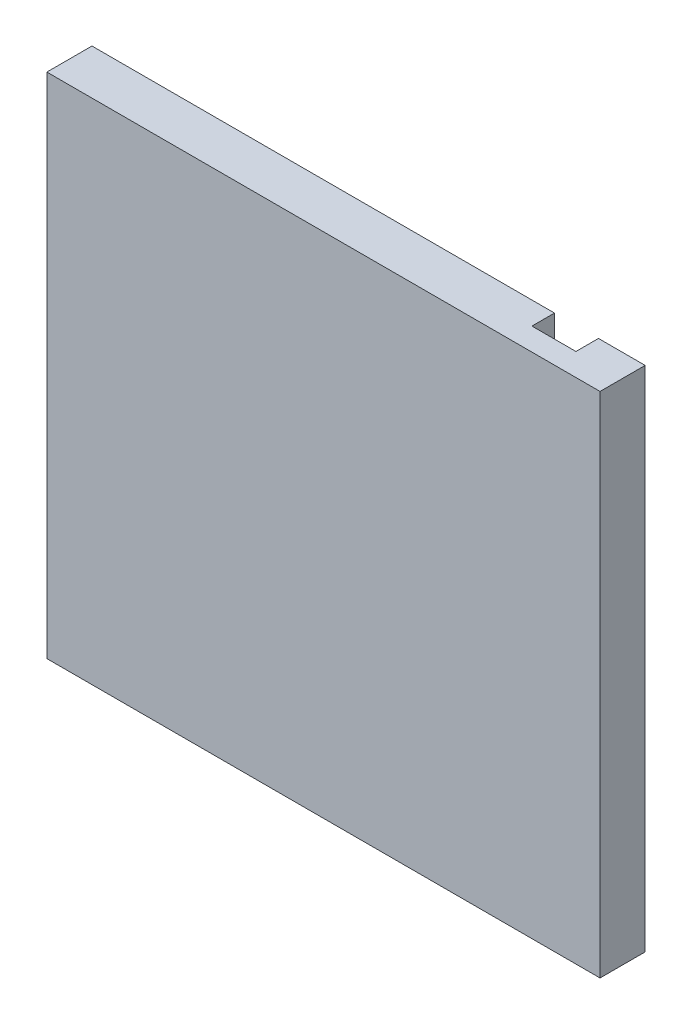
from build123d import *

# Parameters (mm, degrees)
AUFSATZ_LINEAR_AUSTRAGEN1_DEPTH = 9
AUFSATZ_LINEAR_AUSTRAGEN2_DEPTH = 9
SCHNITT_LINEAR_START            = 4
SCHNITT_LINEAR_AUSTRAGEN1_DEPTH = 5
AUFSATZ_LINEAR_AUSTRAGEN4_DEPTH = 5
VERRUNDUNG1_R                   = 0.5
SKIZZE5_W                       = 2.5
SKIZZE5_H                       = 5.6
SCHNITT_LINEAR_AUSTRAGEN2_DEPTH = 7.7
SKIZZE6_R                       = 1.9
SCHNITT_LINEAR_AUSTRAGEN3_DEPTH = 4.65
SCHNITT_LINEAR_AUSTRAGEN4_DEPTH = 3.6
SCHNITT_LINEAR_AUSTRAGEN5_DEPTH = 2
VERRUNDUNG2_R                   = 2
SKIZZE11_W                      = 241.481322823
SKIZZE11_H                      = 193.154019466
SKIZZE11_W_2                    = 49.038618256
SKIZZE11_H_2                    = 45.031610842
SCHNITT_LINEAR_AUSTRAGEN6_DEPTH = 10


with BuildPart() as part:
    # Skizze1 → Aufsatz-Linear austragen1 (new body)
    with BuildSketch(Plane.XY):
        Polygon((-75.6, 50.4), (-75.6, -50.4), (-50.4, -50.4), (-50.4, -75.6), (50.4, -75.6), (50.4, -50.4), (75.6, -50.4), (75.6, 50.4), (50.4, 50.4), (50.4, 75.6), (-50.4, 75.6), (-50.4, 50.4), align=None)
    extrude(amount=AUFSATZ_LINEAR_AUSTRAGEN1_DEPTH)

    # Skizze3 → Aufsatz-Linear austragen2 (add)
    with BuildSketch(Plane.XY.offset(9)):
        Polygon((56.4, 56.4), (56.4, 81.6), (-56.4, 81.6), (-56.4, 56.4), (-81.6, 56.4), (-81.6, -56.4), (-56.4, -56.4), (-56.4, -81.6), (56.4, -81.6), (56.4, -56.4), (81.6, -56.4), (81.6, 56.4), align=None)
    extrude(amount=-AUFSATZ_LINEAR_AUSTRAGEN2_DEPTH)

    # Skizze1_4 → Schnitt-Linear austragen1 (cut)
    with BuildSketch(Plane.XY.offset(SCHNITT_LINEAR_START)):
        Polygon((-75.6, 50.4), (-75.6, -50.4), (-50.4, -50.4), (-50.4, -75.6), (50.4, -75.6), (50.4, -50.4), (75.6, -50.4), (75.6, 50.4), (50.4, 50.4), (50.4, 75.6), (-50.4, 75.6), (-50.4, 50.4), align=None)
    extrude(amount=SCHNITT_LINEAR_AUSTRAGEN1_DEPTH, mode=Mode.SUBTRACT)

    # Skizze4 → Aufsatz-Linear austragen4 (add)
    with BuildSketch(Plane.XY.offset(4)):
        with BuildLine():
            Line((-25.2, 0), (-25.2, -25.2))
            Line((-25.2, -25.2), (0, -25.2))
            Line((0, -25.2), (0, -0.5))
            ThreePointArc((0, -0.5), (0.146446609, -0.146446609), (0.5, 0))
            Line((0.5, 0), (25.2, 0))
            Line((25.2, 0), (25.2, 25.2))
            Line((25.2, 25.2), (0, 25.2))
            Line((0, 25.2), (0, 0.5))
            ThreePointArc((0, 0.5), (-0.146446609, 0.146446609), (-0.5, 0))
            Line((-0.5, 0), (-25.2, 0))
        make_face()
    extrude(amount=AUFSATZ_LINEAR_AUSTRAGEN4_DEPTH)

    # Verrundung1
    verrundung1_edges = [part.edges().sort_by_distance(p)[0] for p in [
        (-25.2, 0, 6.5),
        (-25.2, -25.2, 6.5),
        (0, -25.2, 6.5),
        (25.2, 0, 6.5),
        (25.2, 25.2, 6.5),
        (0, 25.2, 6.5),
        (-50.4, 50.4, 6.5),
        (-75.6, 50.4, 6.5),
        (-75.6, -50.4, 6.5),
        (-50.4, -50.4, 6.5),
        (-50.4, -75.6, 6.5),
        (50.4, -75.6, 6.5),
        (50.4, -50.4, 6.5),
        (75.6, -50.4, 6.5),
        (75.6, 50.4, 6.5),
        (50.4, 50.4, 6.5),
        (50.4, 75.6, 6.5),
        (-50.4, 75.6, 6.5),
    ]]
    fillet(verrundung1_edges, radius=VERRUNDUNG1_R)

    # Skizze5 → Schnitt-Linear austragen2 (cut)
    with BuildSketch(Plane(origin=(0, 0, 0), x_dir=(-1, 0, 0), z_dir=(0, 0, -1))):
        with Locations((-78.9, 30)):
            Rectangle(SKIZZE5_W, SKIZZE5_H)
        with Locations((-78.9, -30)):
            Rectangle(SKIZZE5_W, SKIZZE5_H)
    schnitt_linear_austragen2 = extrude(amount=-SCHNITT_LINEAR_AUSTRAGEN2_DEPTH, mode=Mode.SUBTRACT)

    # Skizze6 → Schnitt-Linear austragen3 (cut)
    with BuildSketch(Plane(origin=(81.6, 0, 0), x_dir=(0, 0, -1), z_dir=(1, 0, 0))):
        with Locations((-4.5, 30)):
            Circle(SKIZZE6_R)
        with Locations((-4.5, -30)):
            Circle(SKIZZE6_R)
    schnitt_linear_austragen3 = extrude(amount=-SCHNITT_LINEAR_AUSTRAGEN3_DEPTH, mode=Mode.SUBTRACT)

    # Spiegeln2: Schnitt-Linear austragen2, Schnitt-Linear austragen3 across plane
    add(schnitt_linear_austragen2.mirror(Plane(origin=(0, 0, 0), x_dir=(0, 0, 1), z_dir=(1, 0, 0))), mode=Mode.SUBTRACT)
    add(schnitt_linear_austragen3.mirror(Plane(origin=(0, 0, 0), x_dir=(0, 0, 1), z_dir=(1, 0, 0))), mode=Mode.SUBTRACT)

    # Skizze7 → Schnitt-Linear austragen4 (cut)
    with BuildSketch(Plane(origin=(0, 0, 0), x_dir=(-1, 0, 0), z_dir=(0, 0, -1))):
        Polygon((-39.4, 65.1), (-39.4, 60.9), (-36.2, 60.9), (-36.2, 61.05), (-34.4, 61.05), (-34.4, 64.95), (-36.2, 64.95), (-36.2, 65.1), align=None)
        Polygon((-64.6, 39.9), (-64.6, 35.7), (-61.4, 35.7), (-61.4, 35.85), (-59.6, 35.85), (-59.6, 39.75), (-61.4, 39.75), (-61.4, 39.9), align=None)
        Polygon((-14.2, -10.5), (-14.2, -14.7), (-11, -14.7), (-11, -14.55), (-9.2, -14.55), (-9.2, -10.65), (-11, -10.65), (-11, -10.5), align=None)
        Polygon((14.2, 14.7), (14.2, 10.5), (11, 10.5), (11, 10.65), (9.2, 10.65), (9.2, 14.55), (11, 14.55), (11, 14.7), align=None)
        Polygon((64.6, -35.7), (64.6, -39.9), (61.4, -39.9), (61.4, -39.75), (59.6, -39.75), (59.6, -35.85), (61.4, -35.85), (61.4, -35.7), align=None)
        Polygon((39.4, -60.9), (39.4, -65.1), (36.2, -65.1), (36.2, -64.95), (34.4, -64.95), (34.4, -61.05), (36.2, -61.05), (36.2, -60.9), align=None)
    extrude(amount=-SCHNITT_LINEAR_AUSTRAGEN4_DEPTH, mode=Mode.SUBTRACT)

    # Skizze9 → Schnitt-Linear austragen5 (cut)
    with BuildSketch(Plane(origin=(0, 0, 0), x_dir=(-1, 0, 0), z_dir=(0, 0, -1))):
        Polygon((-1.95, 64.95), (1.95, 64.95), (1.95, 14.55), (9.2, 14.55), (9.2, 10.65), (1.95, 10.65), (1.95, -35.85), (59.6, -35.85), (59.6, -39.75), (1.95, -39.75), (1.95, -61.05), (34.4, -61.05), (34.4, -64.95), (1.95, -64.95), (-1.95, -64.95), (-1.95, -14.55), (-9.2, -14.55), (-9.2, -10.65), (-1.95, -10.65), (-1.95, 35.85), (-59.6, 35.85), (-59.6, 39.75), (-1.95, 39.75), (-1.95, 61.05), (-34.4, 61.05), (-34.4, 64.95), align=None)
    extrude(amount=-SCHNITT_LINEAR_AUSTRAGEN5_DEPTH, mode=Mode.SUBTRACT)

    # Verrundung2
    verrundung2_edges = [part.edges().sort_by_distance(p)[0] for p in [
        (56.4, 56.4, 4.5),
        (81.6, 56.4, 4.5),
        (81.6, -56.4, 4.5),
        (56.4, -56.4, 4.5),
        (56.4, -81.6, 4.5),
        (-56.4, -81.6, 4.5),
        (-56.4, -56.4, 4.5),
        (-81.6, -56.4, 4.5),
        (-81.6, 56.4, 4.5),
        (-56.4, 56.4, 4.5),
        (-56.4, 81.6, 4.5),
        (56.4, 81.6, 4.5),
    ]]
    fillet(verrundung2_edges, radius=VERRUNDUNG2_R)

    # Skizze11 → Schnitt-Linear austragen6 (cut)
    with BuildSketch(Plane(origin=(0, 0, 0), x_dir=(-1, 0, 0), z_dir=(0, 0, -1))):
        with Locations((15.242244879, -6.767763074)):
            Rectangle(SKIZZE11_W, SKIZZE11_H)
        with Locations((18.432380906, -51.267543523)):
            Rectangle(SKIZZE11_W_2, SKIZZE11_H_2, mode=Mode.SUBTRACT)
    extrude(amount=-SCHNITT_LINEAR_AUSTRAGEN6_DEPTH, mode=Mode.SUBTRACT)


solid = part.part
